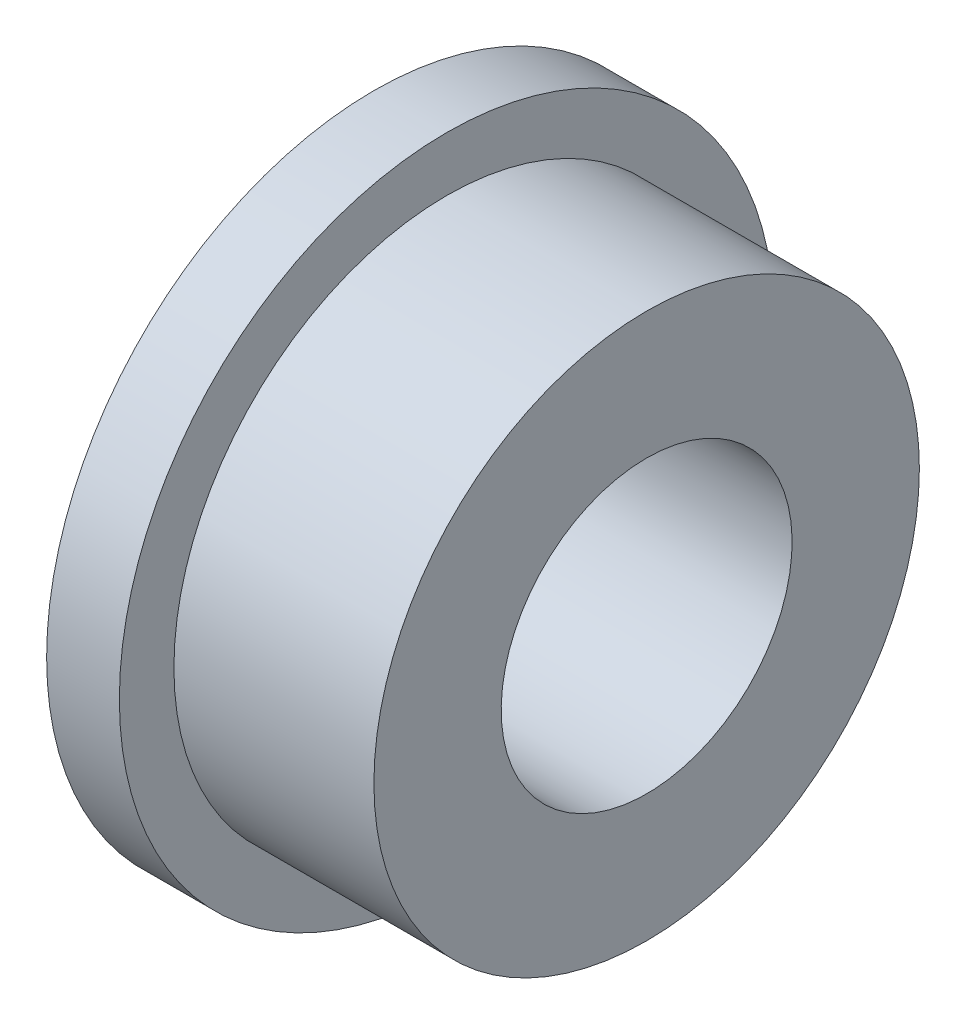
from build123d import *


with BuildPart() as part:
    # Esquisse1 → Base-R_volution (revolve)
    with BuildSketch(Plane.XY):
        Polygon((0, 4), (-7.5, 4), (-7.5, 9), (-5.5, 9), (-5.5, 7.5), (0, 7.5), align=None)
    revolve(axis=Axis((0, 0, 0), (-1, 0, 0)))


solid = part.part
